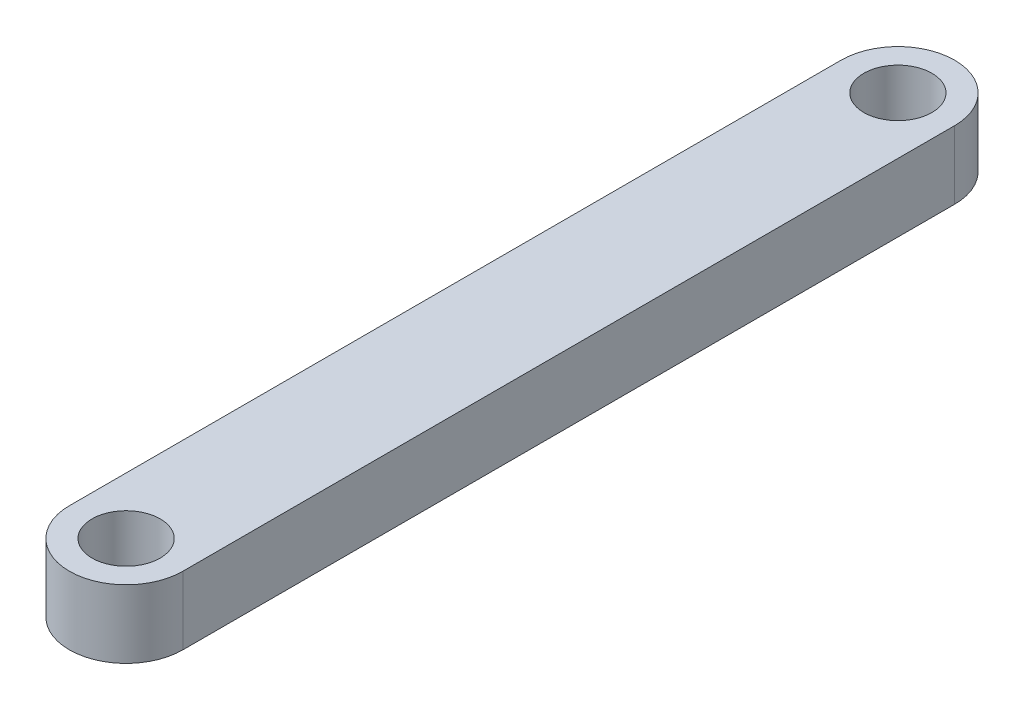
from build123d import *

# Parameters (mm, degrees)
SKETCH1_R           = 1.5
BOSS_EXTRUDE1_DEPTH = 3


with BuildPart() as part:
    # Sketch1 → Boss-Extrude1 (new body)
    with BuildSketch(Plane(origin=(0, 0, 0), x_dir=(1, 0, 0), z_dir=(0, 1, 0))):
        with BuildLine():
            Line((2.5, 34), (2.5, 0))
            ThreePointArc((2.5, 0), (0, -2.5), (-2.5, 0))
            Line((-2.5, 0), (-2.5, 34))
            ThreePointArc((-2.5, 34), (0, 36.5), (2.5, 34))
        make_face()
        with Locations(Location((0, 0, 0), (0, 0, 270))):
            Circle(SKETCH1_R, mode=Mode.SUBTRACT)
        with Locations(Location((0, 34, 0), (0, 0, 270))):
            Circle(SKETCH1_R, mode=Mode.SUBTRACT)
    extrude(amount=BOSS_EXTRUDE1_DEPTH)


solid = part.part
